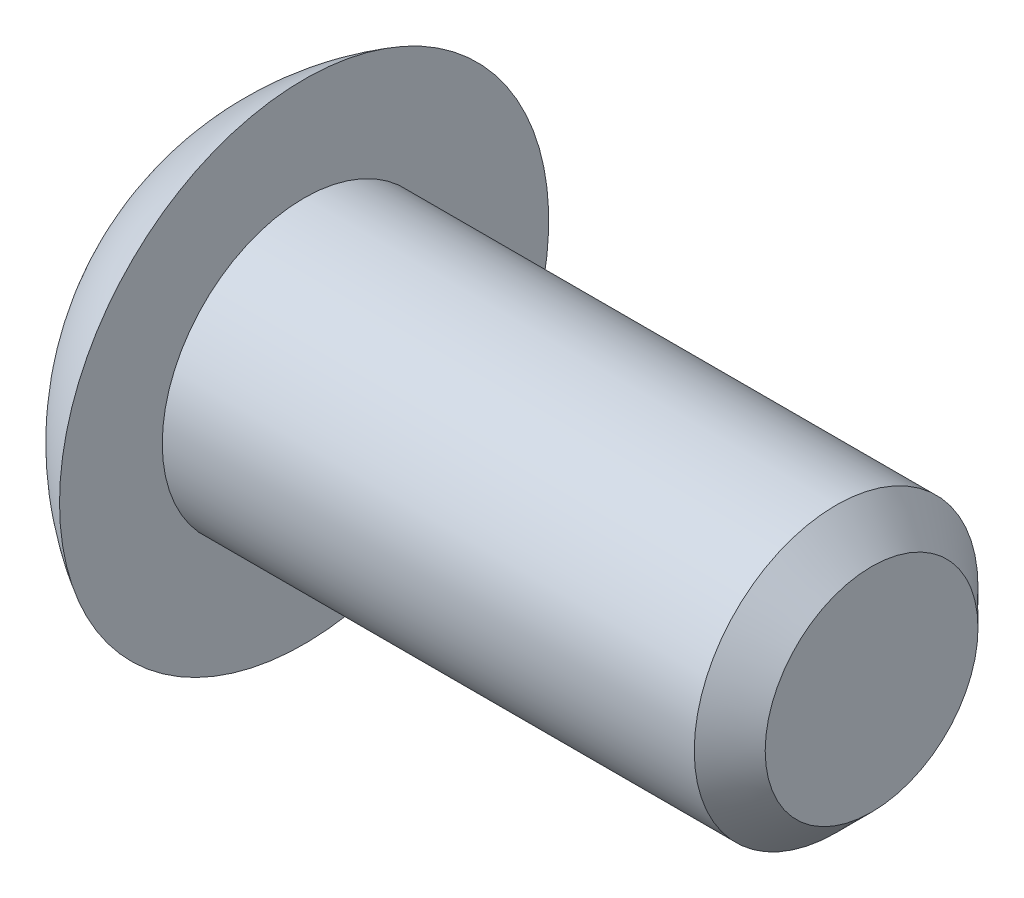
from build123d import *

# Parameters (mm, degrees)
CHANFREIN1_SIZE = 0.5


with BuildPart() as part:
    # Esquisse1 → R_volution1 (revolve)
    with BuildSketch(Plane.XY, mode=Mode.PRIVATE) as r_volution1_sk:
        with BuildLine():
            Line((-40.837193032, 2.000128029), (-40.837193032, 3.448413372))
            ThreePointArc((-40.837193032, 3.448413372), (-42.297351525, 1.991161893), (-42.837193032, 0.000128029))
            Line((-42.837193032, 0.000128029), (-32.837193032, 0.000128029))
            Line((-32.837193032, 0.000128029), (-32.837193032, 2.000128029))
            Line((-32.837193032, 2.000128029), (-40.837193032, 2.000128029))
        make_face()
    revolve(r_volution1_sk.sketch.rotate(Axis((-42.837193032, 0.000128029, 0), (1, 0, 0)), 90), axis=Axis((-42.837193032, 0.000128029, 0), (1, 0, 0)))

    # Chanfrein1
    chanfrein1_edges = [part.edges().sort_by_distance(p)[0] for p in [
        (-32.837193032, 0.000128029, -2),
    ]]
    chamfer(chanfrein1_edges, length=CHANFREIN1_SIZE)


solid = part.part
